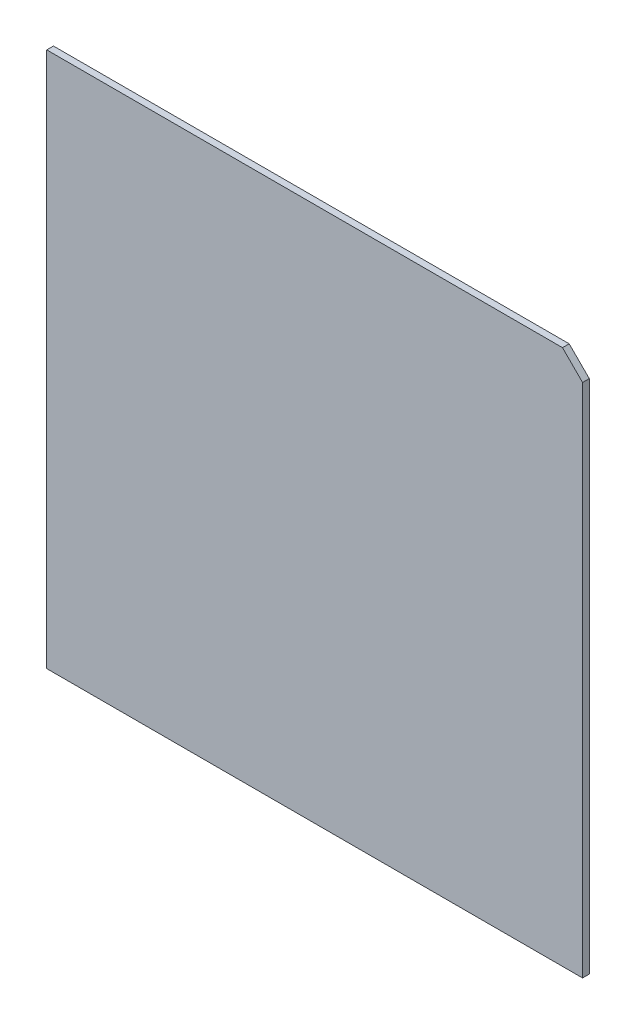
from build123d import *

# Parameters (mm, degrees)
SKETCH2_W           = 2000
SKETCH2_H           = 2000
BOSS_EXTRUDE2_DEPTH = 25
CUT_EXTRUDE1_DEPTH  = 25


with BuildPart() as part:
    # Sketch2 → Boss-Extrude2 (new body)
    with BuildSketch(Plane.XY):
        Rectangle(SKETCH2_W, SKETCH2_H)
    extrude(amount=BOSS_EXTRUDE2_DEPTH)

    # Sketch3 → Cut-Extrude1 (cut)
    with BuildSketch(Plane.XY.offset(25)):
        Polygon((925, 1000), (1000, 925), (1000, 1000), align=None)
    extrude(amount=-CUT_EXTRUDE1_DEPTH, mode=Mode.SUBTRACT)


solid = part.part
